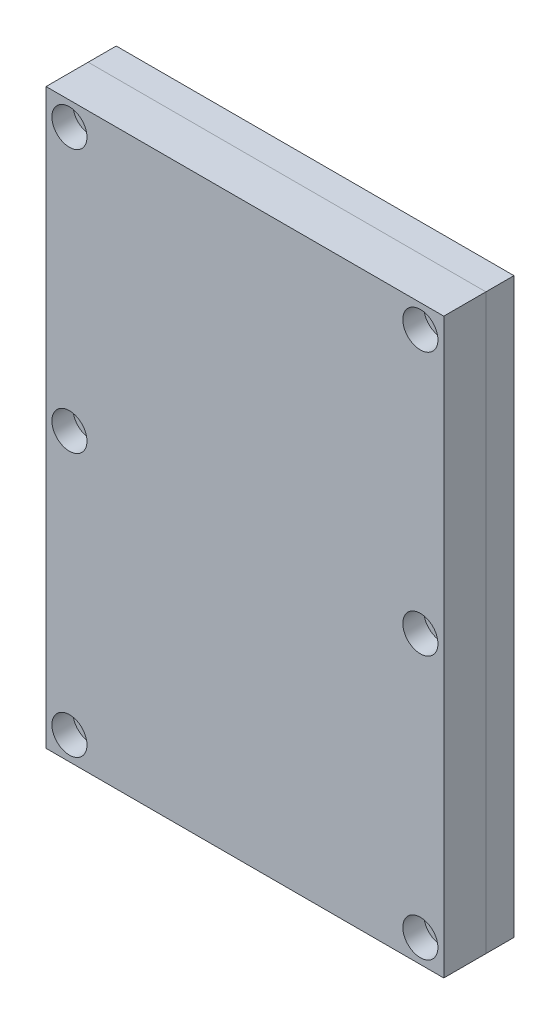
ISO-10303-21;
HEADER;
FILE_DESCRIPTION(('STEP AP214'),'2;1');
FILE_NAME('part.step','',(''),(''),'','','');
FILE_SCHEMA(('AUTOMOTIVE_DESIGN { 1 0 10303 214 1 1 1 1 }'));
ENDSEC;
DATA;
#1=APPLICATION_CONTEXT('core data for automotive mechanical design processes');
#2=APPLICATION_PROTOCOL_DEFINITION('international standard','automotive_design',2000,#1);
#3=PRODUCT_CONTEXT('',#1,'mechanical');
#4=PRODUCT('Part','Part','',(#3));
#5=PRODUCT_RELATED_PRODUCT_CATEGORY('part','',(#4));
#6=PRODUCT_DEFINITION_FORMATION('','',#4);
#7=PRODUCT_DEFINITION_CONTEXT('part definition',#1,'design');
#8=PRODUCT_DEFINITION('design','',#6,#7);
#9=PRODUCT_DEFINITION_SHAPE('','',#8);
#10=(LENGTH_UNIT() NAMED_UNIT(*) SI_UNIT(.MILLI.,.METRE.));
#11=(NAMED_UNIT(*) PLANE_ANGLE_UNIT() SI_UNIT($,.RADIAN.));
#12=(NAMED_UNIT(*) SI_UNIT($,.STERADIAN.) SOLID_ANGLE_UNIT());
#13=UNCERTAINTY_MEASURE_WITH_UNIT(LENGTH_MEASURE(1.E-05),#10,'distance_accuracy_value','');
#14=(GEOMETRIC_REPRESENTATION_CONTEXT(3) GLOBAL_UNCERTAINTY_ASSIGNED_CONTEXT((#13)) GLOBAL_UNIT_ASSIGNED_CONTEXT((#10,
#11,#12)) REPRESENTATION_CONTEXT('',''));
#15=CARTESIAN_POINT('',(0.,0.,0.));
#16=DIRECTION('',(0.,0.,1.));
#17=DIRECTION('',(1.,0.,0.));
#18=AXIS2_PLACEMENT_3D('',#15,#16,#17);
#19=CARTESIAN_POINT('',(75.,-112.5,0.));
#20=DIRECTION('',(0.,0.,1.));
#21=DIRECTION('',(1.,0.,0.));
#22=AXIS2_PLACEMENT_3D('',#19,#20,#21);
#23=CYLINDRICAL_SURFACE('',#22,4.50000000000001);
#24=CARTESIAN_POINT('',(75.,-112.5,12.));
#25=DIRECTION('',(0.,0.,1.));
#26=DIRECTION('',(1.,0.,0.));
#27=AXIS2_PLACEMENT_3D('',#24,#25,#26);
#28=CIRCLE('',#27,4.50000000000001);
#29=CARTESIAN_POINT('',(79.5,-112.5,12.));
#30=VERTEX_POINT('',#29);
#31=EDGE_CURVE('E119',#30,#30,#28,.T.);
#32=ORIENTED_EDGE('',*,*,#31,.F.);
#33=EDGE_LOOP('',(#32));
#34=FACE_BOUND('',#33,.T.);
#35=CARTESIAN_POINT('',(75.,-112.5,21.));
#36=DIRECTION('',(0.,0.,1.));
#37=DIRECTION('',(1.,0.,0.));
#38=AXIS2_PLACEMENT_3D('',#35,#36,#37);
#39=CIRCLE('',#38,4.50000000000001);
#40=CARTESIAN_POINT('',(79.5,-112.5,21.));
#41=VERTEX_POINT('',#40);
#42=EDGE_CURVE('E47',#41,#41,#39,.F.);
#43=ORIENTED_EDGE('',*,*,#42,.F.);
#44=EDGE_LOOP('',(#43));
#45=FACE_BOUND('',#44,.T.);
#46=ADVANCED_FACE('F43',(#34,#45),#23,.F.);
#47=CARTESIAN_POINT('',(-75.,-112.5,0.));
#48=DIRECTION('',(0.,0.,1.));
#49=DIRECTION('',(1.,0.,0.));
#50=AXIS2_PLACEMENT_3D('',#47,#48,#49);
#51=CYLINDRICAL_SURFACE('',#50,4.50000000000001);
#52=CARTESIAN_POINT('',(-75.,-112.5,12.));
#53=DIRECTION('',(0.,0.,1.));
#54=DIRECTION('',(1.,0.,0.));
#55=AXIS2_PLACEMENT_3D('',#52,#53,#54);
#56=CIRCLE('',#55,4.50000000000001);
#57=CARTESIAN_POINT('',(-70.5,-112.5,12.));
#58=VERTEX_POINT('',#57);
#59=EDGE_CURVE('E122',#58,#58,#56,.T.);
#60=ORIENTED_EDGE('',*,*,#59,.F.);
#61=EDGE_LOOP('',(#60));
#62=FACE_BOUND('',#61,.T.);
#63=CARTESIAN_POINT('',(-75.,-112.5,21.));
#64=DIRECTION('',(0.,0.,1.));
#65=DIRECTION('',(1.,0.,0.));
#66=AXIS2_PLACEMENT_3D('',#63,#64,#65);
#67=CIRCLE('',#66,4.50000000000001);
#68=CARTESIAN_POINT('',(-70.5,-112.5,21.));
#69=VERTEX_POINT('',#68);
#70=EDGE_CURVE('E148',#69,#69,#67,.F.);
#71=ORIENTED_EDGE('',*,*,#70,.F.);
#72=EDGE_LOOP('',(#71));
#73=FACE_BOUND('',#72,.T.);
#74=ADVANCED_FACE('F158',(#62,#73),#51,.F.);
#75=CARTESIAN_POINT('',(75.,0.,0.));
#76=DIRECTION('',(0.,0.,1.));
#77=DIRECTION('',(1.,0.,0.));
#78=AXIS2_PLACEMENT_3D('',#75,#76,#77);
#79=CYLINDRICAL_SURFACE('',#78,4.5);
#80=CARTESIAN_POINT('',(75.,0.,12.));
#81=DIRECTION('',(0.,0.,1.));
#82=DIRECTION('',(1.,0.,0.));
#83=AXIS2_PLACEMENT_3D('',#80,#81,#82);
#84=CIRCLE('',#83,4.5);
#85=CARTESIAN_POINT('',(79.5,0.,12.));
#86=VERTEX_POINT('',#85);
#87=EDGE_CURVE('E125',#86,#86,#84,.T.);
#88=ORIENTED_EDGE('',*,*,#87,.F.);
#89=EDGE_LOOP('',(#88));
#90=FACE_BOUND('',#89,.T.);
#91=CARTESIAN_POINT('',(75.,0.,21.));
#92=DIRECTION('',(0.,0.,1.));
#93=DIRECTION('',(1.,0.,0.));
#94=AXIS2_PLACEMENT_3D('',#91,#92,#93);
#95=CIRCLE('',#94,4.5);
#96=CARTESIAN_POINT('',(79.5,0.,21.));
#97=VERTEX_POINT('',#96);
#98=EDGE_CURVE('E146',#97,#97,#95,.F.);
#99=ORIENTED_EDGE('',*,*,#98,.F.);
#100=EDGE_LOOP('',(#99));
#101=FACE_BOUND('',#100,.T.);
#102=ADVANCED_FACE('F164',(#90,#101),#79,.F.);
#103=CARTESIAN_POINT('',(-75.,0.,0.));
#104=DIRECTION('',(0.,0.,1.));
#105=DIRECTION('',(1.,0.,0.));
#106=AXIS2_PLACEMENT_3D('',#103,#104,#105);
#107=CYLINDRICAL_SURFACE('',#106,4.5);
#108=CARTESIAN_POINT('',(-75.,0.,12.));
#109=DIRECTION('',(0.,0.,1.));
#110=DIRECTION('',(1.,0.,0.));
#111=AXIS2_PLACEMENT_3D('',#108,#109,#110);
#112=CIRCLE('',#111,4.5);
#113=CARTESIAN_POINT('',(-70.5,0.,12.));
#114=VERTEX_POINT('',#113);
#115=EDGE_CURVE('E128',#114,#114,#112,.T.);
#116=ORIENTED_EDGE('',*,*,#115,.F.);
#117=EDGE_LOOP('',(#116));
#118=FACE_BOUND('',#117,.T.);
#119=CARTESIAN_POINT('',(-75.,0.,21.));
#120=DIRECTION('',(0.,0.,1.));
#121=DIRECTION('',(1.,0.,0.));
#122=AXIS2_PLACEMENT_3D('',#119,#120,#121);
#123=CIRCLE('',#122,4.5);
#124=CARTESIAN_POINT('',(-70.5,0.,21.));
#125=VERTEX_POINT('',#124);
#126=EDGE_CURVE('E143',#125,#125,#123,.F.);
#127=ORIENTED_EDGE('',*,*,#126,.F.);
#128=EDGE_LOOP('',(#127));
#129=FACE_BOUND('',#128,.T.);
#130=ADVANCED_FACE('F263',(#118,#129),#107,.F.);
#131=CARTESIAN_POINT('',(75.,112.5,0.));
#132=DIRECTION('',(0.,0.,1.));
#133=DIRECTION('',(1.,0.,0.));
#134=AXIS2_PLACEMENT_3D('',#131,#132,#133);
#135=CYLINDRICAL_SURFACE('',#134,4.50000000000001);
#136=CARTESIAN_POINT('',(75.,112.5,12.));
#137=DIRECTION('',(0.,0.,1.));
#138=DIRECTION('',(1.,0.,0.));
#139=AXIS2_PLACEMENT_3D('',#136,#137,#138);
#140=CIRCLE('',#139,4.50000000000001);
#141=CARTESIAN_POINT('',(79.5,112.5,12.));
#142=VERTEX_POINT('',#141);
#143=EDGE_CURVE('E131',#142,#142,#140,.T.);
#144=ORIENTED_EDGE('',*,*,#143,.F.);
#145=EDGE_LOOP('',(#144));
#146=FACE_BOUND('',#145,.T.);
#147=CARTESIAN_POINT('',(75.,112.5,21.));
#148=DIRECTION('',(0.,0.,1.));
#149=DIRECTION('',(1.,0.,0.));
#150=AXIS2_PLACEMENT_3D('',#147,#148,#149);
#151=CIRCLE('',#150,4.50000000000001);
#152=CARTESIAN_POINT('',(79.5,112.5,21.));
#153=VERTEX_POINT('',#152);
#154=EDGE_CURVE('E139',#153,#153,#151,.F.);
#155=ORIENTED_EDGE('',*,*,#154,.F.);
#156=EDGE_LOOP('',(#155));
#157=FACE_BOUND('',#156,.T.);
#158=ADVANCED_FACE('F191',(#146,#157),#135,.F.);
#159=CARTESIAN_POINT('',(-75.,112.5,0.));
#160=DIRECTION('',(0.,0.,1.));
#161=DIRECTION('',(1.,0.,0.));
#162=AXIS2_PLACEMENT_3D('',#159,#160,#161);
#163=CYLINDRICAL_SURFACE('',#162,4.50000000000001);
#164=CARTESIAN_POINT('',(-75.,112.5,12.));
#165=DIRECTION('',(0.,0.,1.));
#166=DIRECTION('',(1.,0.,0.));
#167=AXIS2_PLACEMENT_3D('',#164,#165,#166);
#168=CIRCLE('',#167,4.50000000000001);
#169=CARTESIAN_POINT('',(-70.5,112.5,12.));
#170=VERTEX_POINT('',#169);
#171=EDGE_CURVE('E113',#170,#170,#168,.T.);
#172=ORIENTED_EDGE('',*,*,#171,.F.);
#173=EDGE_LOOP('',(#172));
#174=FACE_BOUND('',#173,.T.);
#175=CARTESIAN_POINT('',(-75.,112.5,21.));
#176=DIRECTION('',(0.,0.,1.));
#177=DIRECTION('',(1.,0.,0.));
#178=AXIS2_PLACEMENT_3D('',#175,#176,#177);
#179=CIRCLE('',#178,4.50000000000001);
#180=CARTESIAN_POINT('',(-70.5,112.5,21.));
#181=VERTEX_POINT('',#180);
#182=EDGE_CURVE('E136',#181,#181,#179,.F.);
#183=ORIENTED_EDGE('',*,*,#182,.F.);
#184=EDGE_LOOP('',(#183));
#185=FACE_BOUND('',#184,.T.);
#186=ADVANCED_FACE('F186',(#174,#185),#163,.F.);
#187=CARTESIAN_POINT('',(-85.,-122.5,30.));
#188=DIRECTION('',(1.,0.,0.));
#189=DIRECTION('',(0.,0.,-1.));
#190=AXIS2_PLACEMENT_3D('',#187,#188,#189);
#191=PLANE('',#190);
#192=DIRECTION('',(0.,-1.,0.));
#193=VECTOR('',#192,1.);
#194=CARTESIAN_POINT('',(-85.,-122.5,12.));
#195=LINE('',#194,#193);
#196=CARTESIAN_POINT('',(-85.,122.5,12.));
#197=VERTEX_POINT('',#196);
#198=CARTESIAN_POINT('',(-85.,-122.5,12.));
#199=VERTEX_POINT('',#198);
#200=EDGE_CURVE('E110',#197,#199,#195,.T.);
#201=ORIENTED_EDGE('',*,*,#200,.T.);
#202=DIRECTION('',(0.,0.,-1.));
#203=VECTOR('',#202,1.);
#204=CARTESIAN_POINT('',(-85.,-122.5,30.));
#205=LINE('',#204,#203);
#206=CARTESIAN_POINT('',(-85.,-122.5,30.));
#207=VERTEX_POINT('',#206);
#208=EDGE_CURVE('E12',#207,#199,#205,.T.);
#209=ORIENTED_EDGE('',*,*,#208,.F.);
#210=DIRECTION('',(0.,-1.,0.));
#211=VECTOR('',#210,1.);
#212=CARTESIAN_POINT('',(-85.,-122.5,30.));
#213=LINE('',#212,#211);
#214=CARTESIAN_POINT('',(-85.,122.5,30.));
#215=VERTEX_POINT('',#214);
#216=EDGE_CURVE('E97',#215,#207,#213,.T.);
#217=ORIENTED_EDGE('',*,*,#216,.F.);
#218=DIRECTION('',(0.,0.,-1.));
#219=VECTOR('',#218,1.);
#220=CARTESIAN_POINT('',(-85.,122.5,30.));
#221=LINE('',#220,#219);
#222=EDGE_CURVE('E106',#215,#197,#221,.T.);
#223=ORIENTED_EDGE('',*,*,#222,.T.);
#224=EDGE_LOOP('',(#201,#209,#217,#223));
#225=FACE_BOUND('',#224,.T.);
#226=ADVANCED_FACE('F45',(#225),#191,.F.);
#227=CARTESIAN_POINT('',(85.,-122.5,30.));
#228=DIRECTION('',(0.,1.,0.));
#229=DIRECTION('',(0.,0.,1.));
#230=AXIS2_PLACEMENT_3D('',#227,#228,#229);
#231=PLANE('',#230);
#232=DIRECTION('',(1.,0.,0.));
#233=VECTOR('',#232,1.);
#234=CARTESIAN_POINT('',(85.,-122.5,12.));
#235=LINE('',#234,#233);
#236=CARTESIAN_POINT('',(85.,-122.5,12.));
#237=VERTEX_POINT('',#236);
#238=EDGE_CURVE('E101',#199,#237,#235,.T.);
#239=ORIENTED_EDGE('',*,*,#238,.T.);
#240=DIRECTION('',(0.,0.,-1.));
#241=VECTOR('',#240,1.);
#242=CARTESIAN_POINT('',(85.,-122.5,30.));
#243=LINE('',#242,#241);
#244=CARTESIAN_POINT('',(85.,-122.5,30.));
#245=VERTEX_POINT('',#244);
#246=EDGE_CURVE('E53',#245,#237,#243,.T.);
#247=ORIENTED_EDGE('',*,*,#246,.F.);
#248=DIRECTION('',(1.,0.,0.));
#249=VECTOR('',#248,1.);
#250=CARTESIAN_POINT('',(85.,-122.5,30.));
#251=LINE('',#250,#249);
#252=EDGE_CURVE('E92',#207,#245,#251,.T.);
#253=ORIENTED_EDGE('',*,*,#252,.F.);
#254=ORIENTED_EDGE('',*,*,#208,.T.);
#255=EDGE_LOOP('',(#239,#247,#253,#254));
#256=FACE_BOUND('',#255,.T.);
#257=ADVANCED_FACE('F100',(#256),#231,.F.);
#258=CARTESIAN_POINT('',(85.,-122.5,30.));
#259=DIRECTION('',(-1.,0.,0.));
#260=DIRECTION('',(0.,0.,1.));
#261=AXIS2_PLACEMENT_3D('',#258,#259,#260);
#262=PLANE('',#261);
#263=DIRECTION('',(0.,1.,0.));
#264=VECTOR('',#263,1.);
#265=CARTESIAN_POINT('',(85.,-122.5,12.));
#266=LINE('',#265,#264);
#267=CARTESIAN_POINT('',(85.,122.5,12.));
#268=VERTEX_POINT('',#267);
#269=EDGE_CURVE('E79',#237,#268,#266,.T.);
#270=ORIENTED_EDGE('',*,*,#269,.T.);
#271=DIRECTION('',(0.,0.,-1.));
#272=VECTOR('',#271,1.);
#273=CARTESIAN_POINT('',(85.,122.5,30.));
#274=LINE('',#273,#272);
#275=CARTESIAN_POINT('',(85.,122.5,30.));
#276=VERTEX_POINT('',#275);
#277=EDGE_CURVE('E102',#276,#268,#274,.T.);
#278=ORIENTED_EDGE('',*,*,#277,.F.);
#279=DIRECTION('',(0.,1.,0.));
#280=VECTOR('',#279,1.);
#281=CARTESIAN_POINT('',(85.,-122.5,30.));
#282=LINE('',#281,#280);
#283=EDGE_CURVE('E95',#245,#276,#282,.T.);
#284=ORIENTED_EDGE('',*,*,#283,.F.);
#285=ORIENTED_EDGE('',*,*,#246,.T.);
#286=EDGE_LOOP('',(#270,#278,#284,#285));
#287=FACE_BOUND('',#286,.T.);
#288=ADVANCED_FACE('F104',(#287),#262,.F.);
#289=CARTESIAN_POINT('',(85.,122.5,30.));
#290=DIRECTION('',(0.,-1.,0.));
#291=DIRECTION('',(0.,0.,-1.));
#292=AXIS2_PLACEMENT_3D('',#289,#290,#291);
#293=PLANE('',#292);
#294=DIRECTION('',(-1.,0.,0.));
#295=VECTOR('',#294,1.);
#296=CARTESIAN_POINT('',(85.,122.5,12.));
#297=LINE('',#296,#295);
#298=EDGE_CURVE('E85',#268,#197,#297,.T.);
#299=ORIENTED_EDGE('',*,*,#298,.T.);
#300=ORIENTED_EDGE('',*,*,#222,.F.);
#301=DIRECTION('',(-1.,0.,0.));
#302=VECTOR('',#301,1.);
#303=CARTESIAN_POINT('',(85.,122.5,30.));
#304=LINE('',#303,#302);
#305=EDGE_CURVE('E62',#276,#215,#304,.T.);
#306=ORIENTED_EDGE('',*,*,#305,.F.);
#307=ORIENTED_EDGE('',*,*,#277,.T.);
#308=EDGE_LOOP('',(#299,#300,#306,#307));
#309=FACE_BOUND('',#308,.T.);
#310=ADVANCED_FACE('F173',(#309),#293,.F.);
#311=CARTESIAN_POINT('',(0.,0.,30.));
#312=DIRECTION('',(0.,0.,1.));
#313=DIRECTION('',(1.,0.,0.));
#314=AXIS2_PLACEMENT_3D('',#311,#312,#313);
#315=PLANE('',#314);
#316=CARTESIAN_POINT('',(75.,-112.5,30.));
#317=DIRECTION('',(0.,0.,1.));
#318=DIRECTION('',(1.,0.,0.));
#319=AXIS2_PLACEMENT_3D('',#316,#317,#318);
#320=CIRCLE('',#319,7.50000000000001);
#321=CARTESIAN_POINT('',(82.5,-112.5,30.));
#322=VERTEX_POINT('',#321);
#323=EDGE_CURVE('E215',#322,#322,#320,.T.);
#324=ORIENTED_EDGE('',*,*,#323,.F.);
#325=EDGE_LOOP('',(#324));
#326=FACE_BOUND('',#325,.T.);
#327=CARTESIAN_POINT('',(-75.,0.,30.));
#328=DIRECTION('',(0.,0.,1.));
#329=DIRECTION('',(1.,0.,0.));
#330=AXIS2_PLACEMENT_3D('',#327,#328,#329);
#331=CIRCLE('',#330,7.50000000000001);
#332=CARTESIAN_POINT('',(-67.5,0.,30.));
#333=VERTEX_POINT('',#332);
#334=EDGE_CURVE('E222',#333,#333,#331,.T.);
#335=ORIENTED_EDGE('',*,*,#334,.F.);
#336=EDGE_LOOP('',(#335));
#337=FACE_BOUND('',#336,.T.);
#338=CARTESIAN_POINT('',(75.,0.,30.));
#339=DIRECTION('',(0.,0.,1.));
#340=DIRECTION('',(1.,0.,0.));
#341=AXIS2_PLACEMENT_3D('',#338,#339,#340);
#342=CIRCLE('',#341,7.50000000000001);
#343=CARTESIAN_POINT('',(82.5,0.,30.));
#344=VERTEX_POINT('',#343);
#345=EDGE_CURVE('E203',#344,#344,#342,.T.);
#346=ORIENTED_EDGE('',*,*,#345,.F.);
#347=EDGE_LOOP('',(#346));
#348=FACE_BOUND('',#347,.T.);
#349=CARTESIAN_POINT('',(75.,112.5,30.));
#350=DIRECTION('',(0.,0.,1.));
#351=DIRECTION('',(1.,0.,0.));
#352=AXIS2_PLACEMENT_3D('',#349,#350,#351);
#353=CIRCLE('',#352,7.50000000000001);
#354=CARTESIAN_POINT('',(82.5,112.5,30.));
#355=VERTEX_POINT('',#354);
#356=EDGE_CURVE('E210',#355,#355,#353,.T.);
#357=ORIENTED_EDGE('',*,*,#356,.F.);
#358=EDGE_LOOP('',(#357));
#359=FACE_BOUND('',#358,.T.);
#360=CARTESIAN_POINT('',(-75.,-112.5,30.));
#361=DIRECTION('',(0.,0.,1.));
#362=DIRECTION('',(1.,0.,0.));
#363=AXIS2_PLACEMENT_3D('',#360,#361,#362);
#364=CIRCLE('',#363,7.50000000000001);
#365=CARTESIAN_POINT('',(-67.5,-112.5,30.));
#366=VERTEX_POINT('',#365);
#367=EDGE_CURVE('E227',#366,#366,#364,.T.);
#368=ORIENTED_EDGE('',*,*,#367,.F.);
#369=EDGE_LOOP('',(#368));
#370=FACE_BOUND('',#369,.T.);
#371=CARTESIAN_POINT('',(-75.,112.5,30.));
#372=DIRECTION('',(0.,0.,1.));
#373=DIRECTION('',(1.,0.,0.));
#374=AXIS2_PLACEMENT_3D('',#371,#372,#373);
#375=CIRCLE('',#374,7.50000000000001);
#376=CARTESIAN_POINT('',(-67.5,112.5,30.));
#377=VERTEX_POINT('',#376);
#378=EDGE_CURVE('E197',#377,#377,#375,.T.);
#379=ORIENTED_EDGE('',*,*,#378,.F.);
#380=EDGE_LOOP('',(#379));
#381=FACE_BOUND('',#380,.T.);
#382=ORIENTED_EDGE('',*,*,#216,.T.);
#383=ORIENTED_EDGE('',*,*,#252,.T.);
#384=ORIENTED_EDGE('',*,*,#283,.T.);
#385=ORIENTED_EDGE('',*,*,#305,.T.);
#386=EDGE_LOOP('',(#382,#383,#384,#385));
#387=FACE_BOUND('',#386,.T.);
#388=ADVANCED_FACE('F93',(#326,#337,#348,#359,#370,#381,#387),#315,.T.);
#389=CARTESIAN_POINT('',(0.,0.,12.));
#390=DIRECTION('',(0.,0.,1.));
#391=DIRECTION('',(1.,0.,0.));
#392=AXIS2_PLACEMENT_3D('',#389,#390,#391);
#393=PLANE('',#392);
#394=ORIENTED_EDGE('',*,*,#171,.T.);
#395=EDGE_LOOP('',(#394));
#396=FACE_BOUND('',#395,.T.);
#397=ORIENTED_EDGE('',*,*,#143,.T.);
#398=EDGE_LOOP('',(#397));
#399=FACE_BOUND('',#398,.T.);
#400=ORIENTED_EDGE('',*,*,#115,.T.);
#401=EDGE_LOOP('',(#400));
#402=FACE_BOUND('',#401,.T.);
#403=ORIENTED_EDGE('',*,*,#87,.T.);
#404=EDGE_LOOP('',(#403));
#405=FACE_BOUND('',#404,.T.);
#406=ORIENTED_EDGE('',*,*,#59,.T.);
#407=EDGE_LOOP('',(#406));
#408=FACE_BOUND('',#407,.T.);
#409=ORIENTED_EDGE('',*,*,#31,.T.);
#410=EDGE_LOOP('',(#409));
#411=FACE_BOUND('',#410,.T.);
#412=ORIENTED_EDGE('',*,*,#200,.F.);
#413=ORIENTED_EDGE('',*,*,#298,.F.);
#414=ORIENTED_EDGE('',*,*,#269,.F.);
#415=ORIENTED_EDGE('',*,*,#238,.F.);
#416=EDGE_LOOP('',(#412,#413,#414,#415));
#417=FACE_BOUND('',#416,.T.);
#418=ADVANCED_FACE('F172',(#396,#399,#402,#405,#408,#411,#417),#393,.F.);
#419=CARTESIAN_POINT('',(-75.,112.5,21.));
#420=DIRECTION('',(0.,0.,1.));
#421=DIRECTION('',(1.,0.,0.));
#422=AXIS2_PLACEMENT_3D('',#419,#420,#421);
#423=PLANE('',#422);
#424=CARTESIAN_POINT('',(-75.,112.5,21.));
#425=DIRECTION('',(0.,0.,1.));
#426=DIRECTION('',(1.,0.,0.));
#427=AXIS2_PLACEMENT_3D('',#424,#425,#426);
#428=CIRCLE('',#427,7.50000000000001);
#429=CARTESIAN_POINT('',(-67.5,112.5,21.));
#430=VERTEX_POINT('',#429);
#431=EDGE_CURVE('E140',#430,#430,#428,.T.);
#432=ORIENTED_EDGE('',*,*,#431,.T.);
#433=EDGE_LOOP('',(#432));
#434=FACE_BOUND('',#433,.T.);
#435=ORIENTED_EDGE('',*,*,#182,.T.);
#436=EDGE_LOOP('',(#435));
#437=FACE_BOUND('',#436,.T.);
#438=ADVANCED_FACE('F177',(#434,#437),#423,.T.);
#439=CARTESIAN_POINT('',(-75.,112.5,21.));
#440=DIRECTION('',(0.,0.,1.));
#441=DIRECTION('',(1.,0.,0.));
#442=AXIS2_PLACEMENT_3D('',#439,#440,#441);
#443=CYLINDRICAL_SURFACE('',#442,7.50000000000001);
#444=ORIENTED_EDGE('',*,*,#431,.F.);
#445=EDGE_LOOP('',(#444));
#446=FACE_BOUND('',#445,.T.);
#447=ORIENTED_EDGE('',*,*,#378,.T.);
#448=EDGE_LOOP('',(#447));
#449=FACE_BOUND('',#448,.T.);
#450=ADVANCED_FACE('F244',(#446,#449),#443,.F.);
#451=CARTESIAN_POINT('',(75.,112.5,21.));
#452=DIRECTION('',(0.,0.,1.));
#453=DIRECTION('',(1.,0.,0.));
#454=AXIS2_PLACEMENT_3D('',#451,#452,#453);
#455=PLANE('',#454);
#456=CARTESIAN_POINT('',(75.,112.5,21.));
#457=DIRECTION('',(0.,0.,1.));
#458=DIRECTION('',(1.,0.,0.));
#459=AXIS2_PLACEMENT_3D('',#456,#457,#458);
#460=CIRCLE('',#459,7.50000000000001);
#461=CARTESIAN_POINT('',(82.5,112.5,21.));
#462=VERTEX_POINT('',#461);
#463=EDGE_CURVE('E200',#462,#462,#460,.T.);
#464=ORIENTED_EDGE('',*,*,#463,.T.);
#465=EDGE_LOOP('',(#464));
#466=FACE_BOUND('',#465,.T.);
#467=ORIENTED_EDGE('',*,*,#154,.T.);
#468=EDGE_LOOP('',(#467));
#469=FACE_BOUND('',#468,.T.);
#470=ADVANCED_FACE('F246',(#466,#469),#455,.T.);
#471=CARTESIAN_POINT('',(75.,112.5,21.));
#472=DIRECTION('',(0.,0.,1.));
#473=DIRECTION('',(1.,0.,0.));
#474=AXIS2_PLACEMENT_3D('',#471,#472,#473);
#475=CYLINDRICAL_SURFACE('',#474,7.50000000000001);
#476=ORIENTED_EDGE('',*,*,#463,.F.);
#477=EDGE_LOOP('',(#476));
#478=FACE_BOUND('',#477,.T.);
#479=ORIENTED_EDGE('',*,*,#356,.T.);
#480=EDGE_LOOP('',(#479));
#481=FACE_BOUND('',#480,.T.);
#482=ADVANCED_FACE('F253',(#478,#481),#475,.F.);
#483=CARTESIAN_POINT('',(-75.,0.,21.));
#484=DIRECTION('',(0.,0.,1.));
#485=DIRECTION('',(1.,0.,0.));
#486=AXIS2_PLACEMENT_3D('',#483,#484,#485);
#487=PLANE('',#486);
#488=CARTESIAN_POINT('',(-75.,0.,21.));
#489=DIRECTION('',(0.,0.,1.));
#490=DIRECTION('',(1.,0.,0.));
#491=AXIS2_PLACEMENT_3D('',#488,#489,#490);
#492=CIRCLE('',#491,7.50000000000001);
#493=CARTESIAN_POINT('',(-67.5,0.,21.));
#494=VERTEX_POINT('',#493);
#495=EDGE_CURVE('E207',#494,#494,#492,.T.);
#496=ORIENTED_EDGE('',*,*,#495,.T.);
#497=EDGE_LOOP('',(#496));
#498=FACE_BOUND('',#497,.T.);
#499=ORIENTED_EDGE('',*,*,#126,.T.);
#500=EDGE_LOOP('',(#499));
#501=FACE_BOUND('',#500,.T.);
#502=ADVANCED_FACE('F286',(#498,#501),#487,.T.);
#503=CARTESIAN_POINT('',(-75.,0.,21.));
#504=DIRECTION('',(0.,0.,1.));
#505=DIRECTION('',(1.,0.,0.));
#506=AXIS2_PLACEMENT_3D('',#503,#504,#505);
#507=CYLINDRICAL_SURFACE('',#506,7.50000000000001);
#508=ORIENTED_EDGE('',*,*,#495,.F.);
#509=EDGE_LOOP('',(#508));
#510=FACE_BOUND('',#509,.T.);
#511=ORIENTED_EDGE('',*,*,#334,.T.);
#512=EDGE_LOOP('',(#511));
#513=FACE_BOUND('',#512,.T.);
#514=ADVANCED_FACE('F278',(#510,#513),#507,.F.);
#515=CARTESIAN_POINT('',(75.,0.,21.));
#516=DIRECTION('',(0.,0.,1.));
#517=DIRECTION('',(1.,0.,0.));
#518=AXIS2_PLACEMENT_3D('',#515,#516,#517);
#519=PLANE('',#518);
#520=CARTESIAN_POINT('',(75.,0.,21.));
#521=DIRECTION('',(0.,0.,1.));
#522=DIRECTION('',(1.,0.,0.));
#523=AXIS2_PLACEMENT_3D('',#520,#521,#522);
#524=CIRCLE('',#523,7.50000000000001);
#525=CARTESIAN_POINT('',(82.5,0.,21.));
#526=VERTEX_POINT('',#525);
#527=EDGE_CURVE('E206',#526,#526,#524,.T.);
#528=ORIENTED_EDGE('',*,*,#527,.T.);
#529=EDGE_LOOP('',(#528));
#530=FACE_BOUND('',#529,.T.);
#531=ORIENTED_EDGE('',*,*,#98,.T.);
#532=EDGE_LOOP('',(#531));
#533=FACE_BOUND('',#532,.T.);
#534=ADVANCED_FACE('F275',(#530,#533),#519,.T.);
#535=CARTESIAN_POINT('',(75.,0.,21.));
#536=DIRECTION('',(0.,0.,1.));
#537=DIRECTION('',(1.,0.,0.));
#538=AXIS2_PLACEMENT_3D('',#535,#536,#537);
#539=CYLINDRICAL_SURFACE('',#538,7.50000000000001);
#540=ORIENTED_EDGE('',*,*,#527,.F.);
#541=EDGE_LOOP('',(#540));
#542=FACE_BOUND('',#541,.T.);
#543=ORIENTED_EDGE('',*,*,#345,.T.);
#544=EDGE_LOOP('',(#543));
#545=FACE_BOUND('',#544,.T.);
#546=ADVANCED_FACE('F277',(#542,#545),#539,.F.);
#547=CARTESIAN_POINT('',(-75.,-112.5,21.));
#548=DIRECTION('',(0.,0.,1.));
#549=DIRECTION('',(1.,0.,0.));
#550=AXIS2_PLACEMENT_3D('',#547,#548,#549);
#551=PLANE('',#550);
#552=CARTESIAN_POINT('',(-75.,-112.5,21.));
#553=DIRECTION('',(0.,0.,1.));
#554=DIRECTION('',(1.,0.,0.));
#555=AXIS2_PLACEMENT_3D('',#552,#553,#554);
#556=CIRCLE('',#555,7.50000000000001);
#557=CARTESIAN_POINT('',(-67.5,-112.5,21.));
#558=VERTEX_POINT('',#557);
#559=EDGE_CURVE('E219',#558,#558,#556,.T.);
#560=ORIENTED_EDGE('',*,*,#559,.T.);
#561=EDGE_LOOP('',(#560));
#562=FACE_BOUND('',#561,.T.);
#563=ORIENTED_EDGE('',*,*,#70,.T.);
#564=EDGE_LOOP('',(#563));
#565=FACE_BOUND('',#564,.T.);
#566=ADVANCED_FACE('F233',(#562,#565),#551,.T.);
#567=CARTESIAN_POINT('',(-75.,-112.5,21.));
#568=DIRECTION('',(0.,0.,1.));
#569=DIRECTION('',(1.,0.,0.));
#570=AXIS2_PLACEMENT_3D('',#567,#568,#569);
#571=CYLINDRICAL_SURFACE('',#570,7.50000000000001);
#572=ORIENTED_EDGE('',*,*,#559,.F.);
#573=EDGE_LOOP('',(#572));
#574=FACE_BOUND('',#573,.T.);
#575=ORIENTED_EDGE('',*,*,#367,.T.);
#576=EDGE_LOOP('',(#575));
#577=FACE_BOUND('',#576,.T.);
#578=ADVANCED_FACE('F235',(#574,#577),#571,.F.);
#579=CARTESIAN_POINT('',(75.,-112.5,21.));
#580=DIRECTION('',(0.,0.,1.));
#581=DIRECTION('',(1.,0.,0.));
#582=AXIS2_PLACEMENT_3D('',#579,#580,#581);
#583=PLANE('',#582);
#584=CARTESIAN_POINT('',(75.,-112.5,21.));
#585=DIRECTION('',(0.,0.,1.));
#586=DIRECTION('',(1.,0.,0.));
#587=AXIS2_PLACEMENT_3D('',#584,#585,#586);
#588=CIRCLE('',#587,7.50000000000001);
#589=CARTESIAN_POINT('',(82.5,-112.5,21.));
#590=VERTEX_POINT('',#589);
#591=EDGE_CURVE('E218',#590,#590,#588,.T.);
#592=ORIENTED_EDGE('',*,*,#591,.T.);
#593=EDGE_LOOP('',(#592));
#594=FACE_BOUND('',#593,.T.);
#595=ORIENTED_EDGE('',*,*,#42,.T.);
#596=EDGE_LOOP('',(#595));
#597=FACE_BOUND('',#596,.T.);
#598=ADVANCED_FACE('F155',(#594,#597),#583,.T.);
#599=CARTESIAN_POINT('',(75.,-112.5,21.));
#600=DIRECTION('',(0.,0.,1.));
#601=DIRECTION('',(1.,0.,0.));
#602=AXIS2_PLACEMENT_3D('',#599,#600,#601);
#603=CYLINDRICAL_SURFACE('',#602,7.50000000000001);
#604=ORIENTED_EDGE('',*,*,#591,.F.);
#605=EDGE_LOOP('',(#604));
#606=FACE_BOUND('',#605,.T.);
#607=ORIENTED_EDGE('',*,*,#323,.T.);
#608=EDGE_LOOP('',(#607));
#609=FACE_BOUND('',#608,.T.);
#610=ADVANCED_FACE('F293',(#606,#609),#603,.F.);
#611=CLOSED_SHELL('',(#46,#74,#102,#130,#158,#186,#226,#257,#288,#310,#388,#418,#438,#450,#470,
#482,#502,#514,#534,#546,#566,#578,#598,#610));
#612=MANIFOLD_SOLID_BREP('B2',#611);
#613=CARTESIAN_POINT('',(-85.,-122.5,12.));
#614=DIRECTION('',(1.,0.,0.));
#615=DIRECTION('',(0.,0.,-1.));
#616=AXIS2_PLACEMENT_3D('',#613,#614,#615);
#617=PLANE('',#616);
#618=DIRECTION('',(0.,-1.,0.));
#619=VECTOR('',#618,1.);
#620=CARTESIAN_POINT('',(-85.,-122.5,0.));
#621=LINE('',#620,#619);
#622=CARTESIAN_POINT('',(-85.,122.5,0.));
#623=VERTEX_POINT('',#622);
#624=CARTESIAN_POINT('',(-85.,-122.5,0.));
#625=VERTEX_POINT('',#624);
#626=EDGE_CURVE('E536',#623,#625,#621,.T.);
#627=ORIENTED_EDGE('',*,*,#626,.T.);
#628=DIRECTION('',(0.,0.,-1.));
#629=VECTOR('',#628,1.);
#630=CARTESIAN_POINT('',(-85.,-122.5,12.));
#631=LINE('',#630,#629);
#632=CARTESIAN_POINT('',(-85.,-122.5,12.));
#633=VERTEX_POINT('',#632);
#634=EDGE_CURVE('E41',#633,#625,#631,.T.);
#635=ORIENTED_EDGE('',*,*,#634,.F.);
#636=DIRECTION('',(0.,-1.,0.));
#637=VECTOR('',#636,1.);
#638=CARTESIAN_POINT('',(-85.,-122.5,12.));
#639=LINE('',#638,#637);
#640=CARTESIAN_POINT('',(-85.,122.5,12.));
#641=VERTEX_POINT('',#640);
#642=EDGE_CURVE('E524',#641,#633,#639,.T.);
#643=ORIENTED_EDGE('',*,*,#642,.F.);
#644=DIRECTION('',(0.,0.,-1.));
#645=VECTOR('',#644,1.);
#646=CARTESIAN_POINT('',(-85.,122.5,12.));
#647=LINE('',#646,#645);
#648=EDGE_CURVE('E532',#641,#623,#647,.T.);
#649=ORIENTED_EDGE('',*,*,#648,.T.);
#650=EDGE_LOOP('',(#627,#635,#643,#649));
#651=FACE_BOUND('',#650,.T.);
#652=ADVANCED_FACE('F473',(#651),#617,.F.);
#653=CARTESIAN_POINT('',(85.,-122.5,12.));
#654=DIRECTION('',(0.,1.,0.));
#655=DIRECTION('',(0.,0.,1.));
#656=AXIS2_PLACEMENT_3D('',#653,#654,#655);
#657=PLANE('',#656);
#658=DIRECTION('',(1.,0.,0.));
#659=VECTOR('',#658,1.);
#660=CARTESIAN_POINT('',(85.,-122.5,0.));
#661=LINE('',#660,#659);
#662=CARTESIAN_POINT('',(85.,-122.5,0.));
#663=VERTEX_POINT('',#662);
#664=EDGE_CURVE('E528',#625,#663,#661,.T.);
#665=ORIENTED_EDGE('',*,*,#664,.T.);
#666=DIRECTION('',(0.,0.,-1.));
#667=VECTOR('',#666,1.);
#668=CARTESIAN_POINT('',(85.,-122.5,12.));
#669=LINE('',#668,#667);
#670=CARTESIAN_POINT('',(85.,-122.5,12.));
#671=VERTEX_POINT('',#670);
#672=EDGE_CURVE('E481',#671,#663,#669,.T.);
#673=ORIENTED_EDGE('',*,*,#672,.F.);
#674=DIRECTION('',(1.,0.,0.));
#675=VECTOR('',#674,1.);
#676=CARTESIAN_POINT('',(85.,-122.5,12.));
#677=LINE('',#676,#675);
#678=EDGE_CURVE('E519',#633,#671,#677,.T.);
#679=ORIENTED_EDGE('',*,*,#678,.F.);
#680=ORIENTED_EDGE('',*,*,#634,.T.);
#681=EDGE_LOOP('',(#665,#673,#679,#680));
#682=FACE_BOUND('',#681,.T.);
#683=ADVANCED_FACE('F527',(#682),#657,.F.);
#684=CARTESIAN_POINT('',(85.,-122.5,12.));
#685=DIRECTION('',(-1.,0.,0.));
#686=DIRECTION('',(0.,0.,1.));
#687=AXIS2_PLACEMENT_3D('',#684,#685,#686);
#688=PLANE('',#687);
#689=DIRECTION('',(0.,1.,0.));
#690=VECTOR('',#689,1.);
#691=CARTESIAN_POINT('',(85.,-122.5,0.));
#692=LINE('',#691,#690);
#693=CARTESIAN_POINT('',(85.,122.5,0.));
#694=VERTEX_POINT('',#693);
#695=EDGE_CURVE('E506',#663,#694,#692,.T.);
#696=ORIENTED_EDGE('',*,*,#695,.T.);
#697=DIRECTION('',(0.,0.,-1.));
#698=VECTOR('',#697,1.);
#699=CARTESIAN_POINT('',(85.,122.5,12.));
#700=LINE('',#699,#698);
#701=CARTESIAN_POINT('',(85.,122.5,12.));
#702=VERTEX_POINT('',#701);
#703=EDGE_CURVE('E529',#702,#694,#700,.T.);
#704=ORIENTED_EDGE('',*,*,#703,.F.);
#705=DIRECTION('',(0.,1.,0.));
#706=VECTOR('',#705,1.);
#707=CARTESIAN_POINT('',(85.,-122.5,12.));
#708=LINE('',#707,#706);
#709=EDGE_CURVE('E522',#671,#702,#708,.T.);
#710=ORIENTED_EDGE('',*,*,#709,.F.);
#711=ORIENTED_EDGE('',*,*,#672,.T.);
#712=EDGE_LOOP('',(#696,#704,#710,#711));
#713=FACE_BOUND('',#712,.T.);
#714=ADVANCED_FACE('F530',(#713),#688,.F.);
#715=CARTESIAN_POINT('',(85.,122.5,12.));
#716=DIRECTION('',(0.,-1.,0.));
#717=DIRECTION('',(0.,0.,-1.));
#718=AXIS2_PLACEMENT_3D('',#715,#716,#717);
#719=PLANE('',#718);
#720=DIRECTION('',(-1.,0.,0.));
#721=VECTOR('',#720,1.);
#722=CARTESIAN_POINT('',(85.,122.5,0.));
#723=LINE('',#722,#721);
#724=EDGE_CURVE('E512',#694,#623,#723,.T.);
#725=ORIENTED_EDGE('',*,*,#724,.T.);
#726=ORIENTED_EDGE('',*,*,#648,.F.);
#727=DIRECTION('',(-1.,0.,0.));
#728=VECTOR('',#727,1.);
#729=CARTESIAN_POINT('',(85.,122.5,12.));
#730=LINE('',#729,#728);
#731=EDGE_CURVE('E489',#702,#641,#730,.T.);
#732=ORIENTED_EDGE('',*,*,#731,.F.);
#733=ORIENTED_EDGE('',*,*,#703,.T.);
#734=EDGE_LOOP('',(#725,#726,#732,#733));
#735=FACE_BOUND('',#734,.T.);
#736=ADVANCED_FACE('F544',(#735),#719,.F.);
#737=CARTESIAN_POINT('',(0.,0.,12.));
#738=DIRECTION('',(0.,0.,1.));
#739=DIRECTION('',(1.,0.,0.));
#740=AXIS2_PLACEMENT_3D('',#737,#738,#739);
#741=PLANE('',#740);
#742=CARTESIAN_POINT('',(-75.,112.5,12.));
#743=DIRECTION('',(0.,0.,1.));
#744=DIRECTION('',(1.,0.,0.));
#745=AXIS2_PLACEMENT_3D('',#742,#743,#744);
#746=CIRCLE('',#745,4.50000000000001);
#747=CARTESIAN_POINT('',(-70.5,112.5,12.));
#748=VERTEX_POINT('',#747);
#749=EDGE_CURVE('E539',#748,#748,#746,.T.);
#750=ORIENTED_EDGE('',*,*,#749,.F.);
#751=EDGE_LOOP('',(#750));
#752=FACE_BOUND('',#751,.T.);
#753=CARTESIAN_POINT('',(75.,112.5,12.));
#754=DIRECTION('',(0.,0.,1.));
#755=DIRECTION('',(1.,0.,0.));
#756=AXIS2_PLACEMENT_3D('',#753,#754,#755);
#757=CIRCLE('',#756,4.50000000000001);
#758=CARTESIAN_POINT('',(79.5,112.5,12.));
#759=VERTEX_POINT('',#758);
#760=EDGE_CURVE('E552',#759,#759,#757,.T.);
#761=ORIENTED_EDGE('',*,*,#760,.F.);
#762=EDGE_LOOP('',(#761));
#763=FACE_BOUND('',#762,.T.);
#764=CARTESIAN_POINT('',(-75.,0.,12.));
#765=DIRECTION('',(0.,0.,1.));
#766=DIRECTION('',(1.,0.,0.));
#767=AXIS2_PLACEMENT_3D('',#764,#765,#766);
#768=CIRCLE('',#767,4.5);
#769=CARTESIAN_POINT('',(-70.5,0.,12.));
#770=VERTEX_POINT('',#769);
#771=EDGE_CURVE('E555',#770,#770,#768,.T.);
#772=ORIENTED_EDGE('',*,*,#771,.F.);
#773=EDGE_LOOP('',(#772));
#774=FACE_BOUND('',#773,.T.);
#775=CARTESIAN_POINT('',(75.,0.,12.));
#776=DIRECTION('',(0.,0.,1.));
#777=DIRECTION('',(1.,0.,0.));
#778=AXIS2_PLACEMENT_3D('',#775,#776,#777);
#779=CIRCLE('',#778,4.5);
#780=CARTESIAN_POINT('',(79.5,0.,12.));
#781=VERTEX_POINT('',#780);
#782=EDGE_CURVE('E558',#781,#781,#779,.T.);
#783=ORIENTED_EDGE('',*,*,#782,.F.);
#784=EDGE_LOOP('',(#783));
#785=FACE_BOUND('',#784,.T.);
#786=CARTESIAN_POINT('',(-75.,-112.5,12.));
#787=DIRECTION('',(0.,0.,1.));
#788=DIRECTION('',(1.,0.,0.));
#789=AXIS2_PLACEMENT_3D('',#786,#787,#788);
#790=CIRCLE('',#789,4.50000000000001);
#791=CARTESIAN_POINT('',(-70.5,-112.5,12.));
#792=VERTEX_POINT('',#791);
#793=EDGE_CURVE('E561',#792,#792,#790,.T.);
#794=ORIENTED_EDGE('',*,*,#793,.F.);
#795=EDGE_LOOP('',(#794));
#796=FACE_BOUND('',#795,.T.);
#797=CARTESIAN_POINT('',(75.,-112.5,12.));
#798=DIRECTION('',(0.,0.,1.));
#799=DIRECTION('',(1.,0.,0.));
#800=AXIS2_PLACEMENT_3D('',#797,#798,#799);
#801=CIRCLE('',#800,4.50000000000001);
#802=CARTESIAN_POINT('',(79.5,-112.5,12.));
#803=VERTEX_POINT('',#802);
#804=EDGE_CURVE('E564',#803,#803,#801,.T.);
#805=ORIENTED_EDGE('',*,*,#804,.F.);
#806=EDGE_LOOP('',(#805));
#807=FACE_BOUND('',#806,.T.);
#808=ORIENTED_EDGE('',*,*,#642,.T.);
#809=ORIENTED_EDGE('',*,*,#678,.T.);
#810=ORIENTED_EDGE('',*,*,#709,.T.);
#811=ORIENTED_EDGE('',*,*,#731,.T.);
#812=EDGE_LOOP('',(#808,#809,#810,#811));
#813=FACE_BOUND('',#812,.T.);
#814=ADVANCED_FACE('F520',(#752,#763,#774,#785,#796,#807,#813),#741,.T.);
#815=CARTESIAN_POINT('',(0.,0.,0.));
#816=DIRECTION('',(0.,0.,1.));
#817=DIRECTION('',(1.,0.,0.));
#818=AXIS2_PLACEMENT_3D('',#815,#816,#817);
#819=PLANE('',#818);
#820=CARTESIAN_POINT('',(-75.,112.5,0.));
#821=DIRECTION('',(0.,0.,1.));
#822=DIRECTION('',(1.,0.,0.));
#823=AXIS2_PLACEMENT_3D('',#820,#821,#822);
#824=CIRCLE('',#823,4.50000000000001);
#825=CARTESIAN_POINT('',(-70.5,112.5,0.));
#826=VERTEX_POINT('',#825);
#827=EDGE_CURVE('E567',#826,#826,#824,.T.);
#828=ORIENTED_EDGE('',*,*,#827,.T.);
#829=EDGE_LOOP('',(#828));
#830=FACE_BOUND('',#829,.T.);
#831=CARTESIAN_POINT('',(75.,112.5,0.));
#832=DIRECTION('',(0.,0.,1.));
#833=DIRECTION('',(1.,0.,0.));
#834=AXIS2_PLACEMENT_3D('',#831,#832,#833);
#835=CIRCLE('',#834,4.50000000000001);
#836=CARTESIAN_POINT('',(79.5,112.5,0.));
#837=VERTEX_POINT('',#836);
#838=EDGE_CURVE('E580',#837,#837,#835,.T.);
#839=ORIENTED_EDGE('',*,*,#838,.T.);
#840=EDGE_LOOP('',(#839));
#841=FACE_BOUND('',#840,.T.);
#842=CARTESIAN_POINT('',(-75.,0.,0.));
#843=DIRECTION('',(0.,0.,1.));
#844=DIRECTION('',(1.,0.,0.));
#845=AXIS2_PLACEMENT_3D('',#842,#843,#844);
#846=CIRCLE('',#845,4.5);
#847=CARTESIAN_POINT('',(-70.5,0.,0.));
#848=VERTEX_POINT('',#847);
#849=EDGE_CURVE('E577',#848,#848,#846,.T.);
#850=ORIENTED_EDGE('',*,*,#849,.T.);
#851=EDGE_LOOP('',(#850));
#852=FACE_BOUND('',#851,.T.);
#853=CARTESIAN_POINT('',(75.,0.,0.));
#854=DIRECTION('',(0.,0.,1.));
#855=DIRECTION('',(1.,0.,0.));
#856=AXIS2_PLACEMENT_3D('',#853,#854,#855);
#857=CIRCLE('',#856,4.5);
#858=CARTESIAN_POINT('',(79.5,0.,0.));
#859=VERTEX_POINT('',#858);
#860=EDGE_CURVE('E574',#859,#859,#857,.T.);
#861=ORIENTED_EDGE('',*,*,#860,.T.);
#862=EDGE_LOOP('',(#861));
#863=FACE_BOUND('',#862,.T.);
#864=CARTESIAN_POINT('',(-75.,-112.5,0.));
#865=DIRECTION('',(0.,0.,1.));
#866=DIRECTION('',(1.,0.,0.));
#867=AXIS2_PLACEMENT_3D('',#864,#865,#866);
#868=CIRCLE('',#867,4.50000000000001);
#869=CARTESIAN_POINT('',(-70.5,-112.5,0.));
#870=VERTEX_POINT('',#869);
#871=EDGE_CURVE('E571',#870,#870,#868,.T.);
#872=ORIENTED_EDGE('',*,*,#871,.T.);
#873=EDGE_LOOP('',(#872));
#874=FACE_BOUND('',#873,.T.);
#875=CARTESIAN_POINT('',(75.,-112.5,0.));
#876=DIRECTION('',(0.,0.,1.));
#877=DIRECTION('',(1.,0.,0.));
#878=AXIS2_PLACEMENT_3D('',#875,#876,#877);
#879=CIRCLE('',#878,4.50000000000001);
#880=CARTESIAN_POINT('',(79.5,-112.5,0.));
#881=VERTEX_POINT('',#880);
#882=EDGE_CURVE('E568',#881,#881,#879,.T.);
#883=ORIENTED_EDGE('',*,*,#882,.T.);
#884=EDGE_LOOP('',(#883));
#885=FACE_BOUND('',#884,.T.);
#886=ORIENTED_EDGE('',*,*,#626,.F.);
#887=ORIENTED_EDGE('',*,*,#724,.F.);
#888=ORIENTED_EDGE('',*,*,#695,.F.);
#889=ORIENTED_EDGE('',*,*,#664,.F.);
#890=EDGE_LOOP('',(#886,#887,#888,#889));
#891=FACE_BOUND('',#890,.T.);
#892=ADVANCED_FACE('F547',(#830,#841,#852,#863,#874,#885,#891),#819,.F.);
#893=CARTESIAN_POINT('',(75.,-112.5,0.));
#894=DIRECTION('',(0.,0.,1.));
#895=DIRECTION('',(1.,0.,0.));
#896=AXIS2_PLACEMENT_3D('',#893,#894,#895);
#897=CYLINDRICAL_SURFACE('',#896,4.50000000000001);
#898=ORIENTED_EDGE('',*,*,#804,.T.);
#899=EDGE_LOOP('',(#898));
#900=FACE_BOUND('',#899,.T.);
#901=ORIENTED_EDGE('',*,*,#882,.F.);
#902=EDGE_LOOP('',(#901));
#903=FACE_BOUND('',#902,.T.);
#904=ADVANCED_FACE('F612',(#900,#903),#897,.F.);
#905=CARTESIAN_POINT('',(-75.,-112.5,0.));
#906=DIRECTION('',(0.,0.,1.));
#907=DIRECTION('',(1.,0.,0.));
#908=AXIS2_PLACEMENT_3D('',#905,#906,#907);
#909=CYLINDRICAL_SURFACE('',#908,4.50000000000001);
#910=ORIENTED_EDGE('',*,*,#793,.T.);
#911=EDGE_LOOP('',(#910));
#912=FACE_BOUND('',#911,.T.);
#913=ORIENTED_EDGE('',*,*,#871,.F.);
#914=EDGE_LOOP('',(#913));
#915=FACE_BOUND('',#914,.T.);
#916=ADVANCED_FACE('F618',(#912,#915),#909,.F.);
#917=CARTESIAN_POINT('',(75.,0.,0.));
#918=DIRECTION('',(0.,0.,1.));
#919=DIRECTION('',(1.,0.,0.));
#920=AXIS2_PLACEMENT_3D('',#917,#918,#919);
#921=CYLINDRICAL_SURFACE('',#920,4.5);
#922=ORIENTED_EDGE('',*,*,#782,.T.);
#923=EDGE_LOOP('',(#922));
#924=FACE_BOUND('',#923,.T.);
#925=ORIENTED_EDGE('',*,*,#860,.F.);
#926=EDGE_LOOP('',(#925));
#927=FACE_BOUND('',#926,.T.);
#928=ADVANCED_FACE('F622',(#924,#927),#921,.F.);
#929=CARTESIAN_POINT('',(-75.,0.,0.));
#930=DIRECTION('',(0.,0.,1.));
#931=DIRECTION('',(1.,0.,0.));
#932=AXIS2_PLACEMENT_3D('',#929,#930,#931);
#933=CYLINDRICAL_SURFACE('',#932,4.5);
#934=ORIENTED_EDGE('',*,*,#771,.T.);
#935=EDGE_LOOP('',(#934));
#936=FACE_BOUND('',#935,.T.);
#937=ORIENTED_EDGE('',*,*,#849,.F.);
#938=EDGE_LOOP('',(#937));
#939=FACE_BOUND('',#938,.T.);
#940=ADVANCED_FACE('F596',(#936,#939),#933,.F.);
#941=CARTESIAN_POINT('',(75.,112.5,0.));
#942=DIRECTION('',(0.,0.,1.));
#943=DIRECTION('',(1.,0.,0.));
#944=AXIS2_PLACEMENT_3D('',#941,#942,#943);
#945=CYLINDRICAL_SURFACE('',#944,4.50000000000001);
#946=ORIENTED_EDGE('',*,*,#760,.T.);
#947=EDGE_LOOP('',(#946));
#948=FACE_BOUND('',#947,.T.);
#949=ORIENTED_EDGE('',*,*,#838,.F.);
#950=EDGE_LOOP('',(#949));
#951=FACE_BOUND('',#950,.T.);
#952=ADVANCED_FACE('F590',(#948,#951),#945,.F.);
#953=CARTESIAN_POINT('',(-75.,112.5,0.));
#954=DIRECTION('',(0.,0.,1.));
#955=DIRECTION('',(1.,0.,0.));
#956=AXIS2_PLACEMENT_3D('',#953,#954,#955);
#957=CYLINDRICAL_SURFACE('',#956,4.50000000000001);
#958=ORIENTED_EDGE('',*,*,#749,.T.);
#959=EDGE_LOOP('',(#958));
#960=FACE_BOUND('',#959,.T.);
#961=ORIENTED_EDGE('',*,*,#827,.F.);
#962=EDGE_LOOP('',(#961));
#963=FACE_BOUND('',#962,.T.);
#964=ADVANCED_FACE('F588',(#960,#963),#957,.F.);
#965=CLOSED_SHELL('',(#652,#683,#714,#736,#814,#892,#904,#916,#928,#940,#952,#964));
#966=MANIFOLD_SOLID_BREP('B6',#965);
#967=ADVANCED_BREP_SHAPE_REPRESENTATION('',(#18,#612,#966),#14);
#968=SHAPE_DEFINITION_REPRESENTATION(#9,#967);
ENDSEC;
END-ISO-10303-21;
